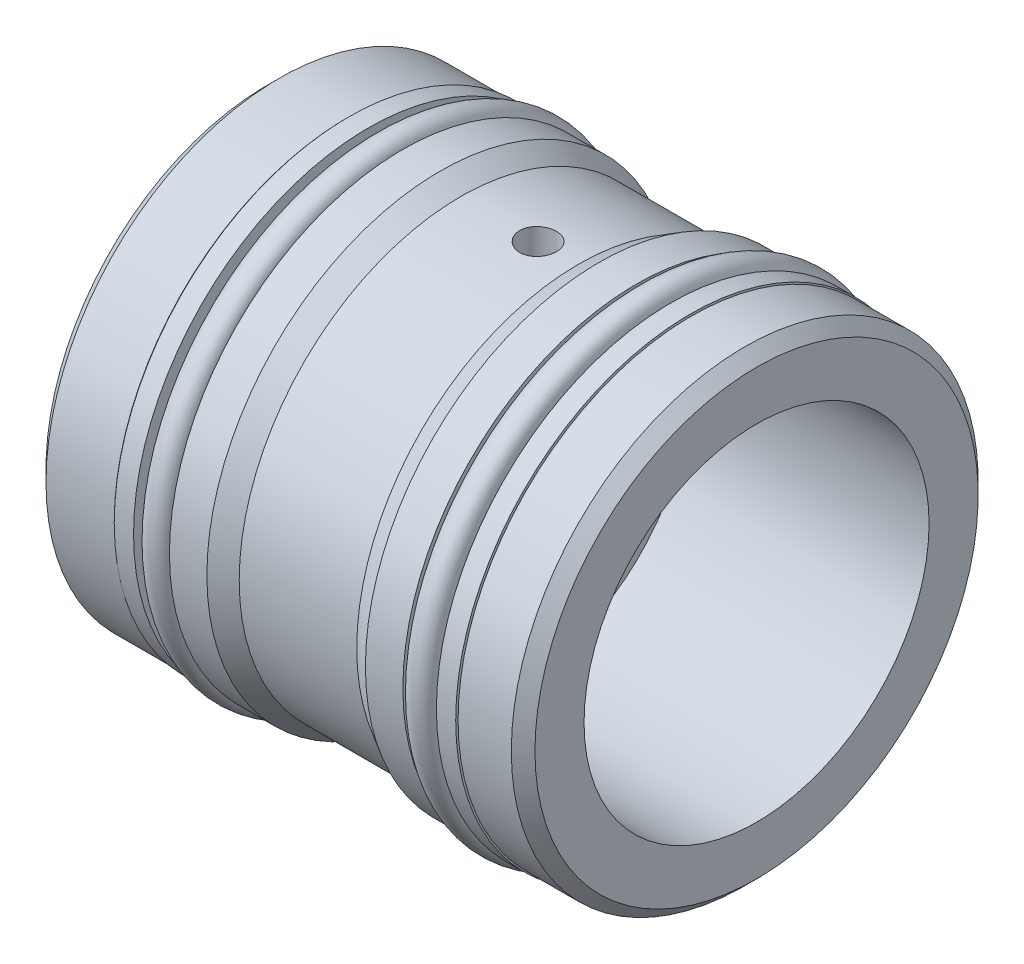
from build123d import *

# Parameters (mm, degrees)
FILLET1_R               = 0.381
CHAMFER1_SIZE           = 0.762
SKETCH6_R               = 0.889
SKETCH6_W               = 1.2446
SKETCH6_H               = 1.3462
CUT_EXTRUDE1_DEPTH      = 27.954678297
CUT_EXTRUDE1_DEPTH_BACK = 27.954678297
SKETCH7_R               = 1.1811


with BuildPart() as part:
    # Sketch1 → Revolve1 (revolve)
    with BuildSketch(Plane.XY, mode=Mode.PRIVATE) as revolve1_sk:
        Polygon((-15.748, 6.35), (-15.748, 15.0368), (-10.5918, 15.0368), (-10.5918, 13.7668), (-7.0358, 13.7668), (-7.0358, 15.0368), (-4.6228, 15.0368), (-4.6228, 14.2748), (5.588, 14.2748), (5.588, 15.0368), (8.001, 15.0368), (8.001, 13.7668), (11.557, 13.7668), (11.557, 15.0368), (15.748, 15.0368), (15.748, 11.1125), (0.3556, 11.1125), (0.3556, 6.35), align=None)
    revolve(revolve1_sk.sketch.rotate(Axis((0, 0, 0), (1, 0, 0)), 90), axis=Axis((0, 0, 0), (1, 0, 0)))

    # Fillet1
    fillet1_edges = [part.edges().sort_by_distance(p)[0] for p in [
        (-4.6228, 0, -14.2748),
        (5.588, 0, -14.2748),
    ]]
    fillet(fillet1_edges, radius=FILLET1_R)

    # Chamfer1
    chamfer1_edges = [part.edges().sort_by_distance(p)[0] for p in [
        (-15.748, 0, -15.0368),
        (15.748, 0, -15.0368),
    ]]
    chamfer(chamfer1_edges, length=CHAMFER1_SIZE)

    # Sketch6 → Revolve3 (revolve)
    with BuildSketch(Plane.XY, mode=Mode.PRIVATE) as revolve3_sk:
        with Locations((-8.001, 14.5796)):
            Circle(SKETCH6_R)
        with Locations((8.9662, 14.5796)):
            Circle(SKETCH6_R)
        with Locations((-9.8933, 14.4399)):
            Rectangle(SKETCH6_W, SKETCH6_H)
        with Locations((10.8585, 14.4399)):
            Rectangle(SKETCH6_W, SKETCH6_H)
    revolve(revolve3_sk.sketch.rotate(Axis((0, 0, 0), (1, 0, 0)), 90), axis=Axis((0, 0, 0), (1, 0, 0)))

    # Sketch7 → Cut-Extrude1 (cut, two sides: drawn at the far end of the back side and taken through both)
    with BuildSketch(Plane(origin=(0, 0, 0), x_dir=(0, 0, -1), z_dir=(0, 1, 0)).offset(-CUT_EXTRUDE1_DEPTH_BACK)):
        with Locations(Location((0, -1.6764, 0), (0, 0, 180))):
            Circle(SKETCH7_R)
    extrude(amount=CUT_EXTRUDE1_DEPTH + CUT_EXTRUDE1_DEPTH_BACK, mode=Mode.SUBTRACT)

    # Sketch8 → Revolve4 (revolve)
    with BuildSketch(Plane.XY, mode=Mode.PRIVATE) as revolve4_sk:
        Polygon((-4.6228, 15.0368), (-3.302977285, 14.2748), (-4.6228, 14.2748), align=None)
        Polygon((5.588, 14.2748), (5.588, 15.0368), (4.268177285, 14.2748), align=None)
    revolve(revolve4_sk.sketch.rotate(Axis((0, 0, 0), (1, 0, 0)), 90), axis=Axis((0, 0, 0), (1, 0, 0)))


solid = part.part
